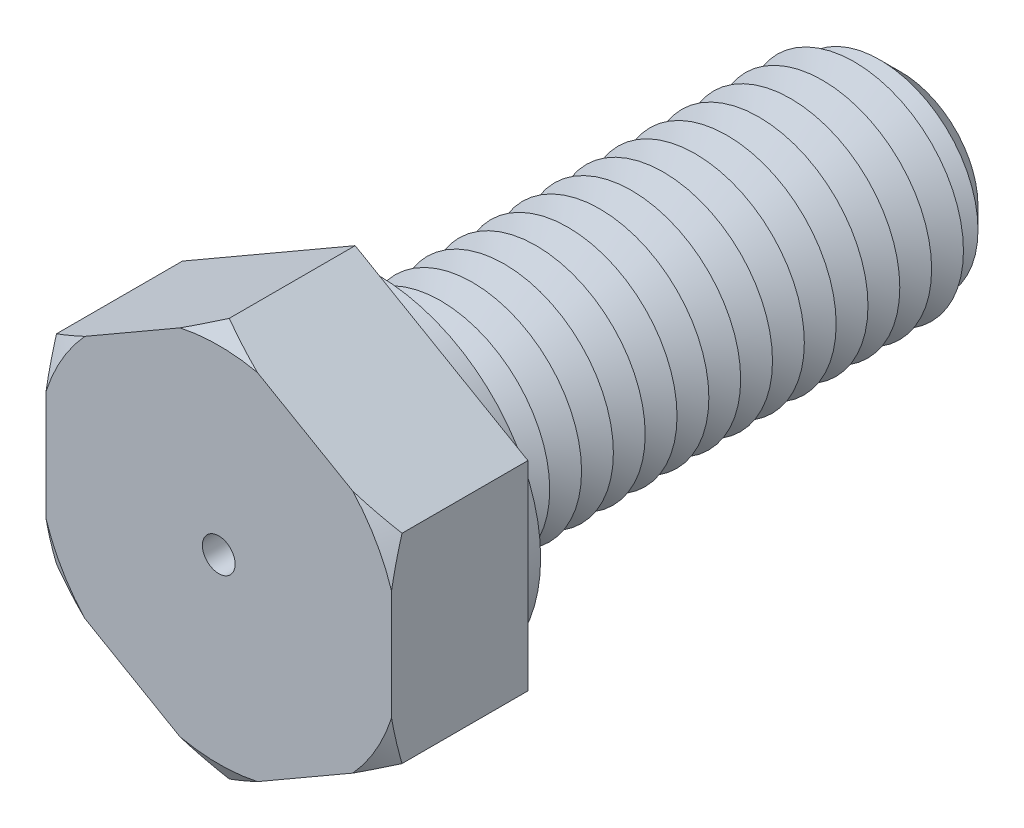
from build123d import *

# Parameters (mm, degrees)
BOSS_EXTRUDE1_DEPTH = 7.5
SKETCH3_R           = 6
BOSS_EXTRUDE2_DEPTH = 30
SKETCH4_R           = 9
BOSS_EXTRUDE3_DEPTH = 1.2
CHAMFER1_SIZE       = 1.75
LPATTERN1_COUNT     = 16
LPATTERN1_PITCH     = 1.75
SKETCH8_R           = 0.9
CUT_EXTRUDE1_DEPTH  = 37.5


with BuildPart() as part:
    # Sketch2 → Boss-Extrude1 (new body)
    with BuildSketch(Plane.XY):
        Polygon((0, 10.969655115), (-9.5, 5.484827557), (-9.5, -5.484827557), (0, -10.969655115), (9.5, -5.484827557), (9.5, 5.484827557), align=None)
    extrude(amount=BOSS_EXTRUDE1_DEPTH)

    # Sketch3 → Boss-Extrude2 (add)
    with BuildSketch(Plane(origin=(0, 0, 0), x_dir=(-1, 0, 0), z_dir=(0, 0, -1))):
        Circle(SKETCH3_R)
    extrude(amount=BOSS_EXTRUDE2_DEPTH)

    # Sketch4 → Boss-Extrude3 (add)
    with BuildSketch(Plane(origin=(0, 0, 0), x_dir=(-1, 0, 0), z_dir=(0, 0, -1))):
        with Locations(Location((0, 0, 0), (0, 0, 180))):
            Circle(SKETCH4_R)
    extrude(amount=BOSS_EXTRUDE3_DEPTH)

    # Chamfer1
    chamfer1_edges = [part.edges().sort_by_distance(p)[0] for p in [
        (6, 0, -30),
    ]]
    chamfer(chamfer1_edges, length=CHAMFER1_SIZE)

    # Sketch6 → Cut-Revolve1 (revolve, cut)
    with BuildSketch(Plane(origin=(0, 0, 0), x_dir=(0, 0, -1), z_dir=(1, 0, 0)), mode=Mode.PRIVATE) as cut_revolve1_sk:
        Polygon((1.2, 6), (2.075, 4.484455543), (2.95, 6), align=None)
    cut_revolve1 = revolve(cut_revolve1_sk.sketch.rotate(Axis((0, 0, 3.211670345), (0, 0, -1)), 90), axis=Axis((0, 0, 3.211670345), (0, 0, -1)), mode=Mode.SUBTRACT)

    # LPattern1: Cut-Revolve1 ×16
    with Locations(*[(0, 0, -i * LPATTERN1_PITCH) for i in range(1, LPATTERN1_COUNT)]):
        add(cut_revolve1, mode=Mode.SUBTRACT)

    # Sketch7 → Cut-Revolve2 (revolve, cut)
    with BuildSketch(Plane(origin=(0, 0, 0), x_dir=(0, 0, -1), z_dir=(1, 0, 0)), mode=Mode.PRIVATE) as cut_revolve2_sk:
        Polygon((-7.5, 10.969655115), (-7.5, 9.969655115), (-6.922649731, 10.969655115), align=None)
    revolve(cut_revolve2_sk.sketch.rotate(Axis((0, 0, 3.211670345), (0, 0, -1)), 90), axis=Axis((0, 0, 3.211670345), (0, 0, -1)), mode=Mode.SUBTRACT)

    # Sketch8 → Cut-Extrude1 (cut)
    with BuildSketch(Plane.XY.offset(7.5)):
        Circle(SKETCH8_R)
    extrude(amount=-CUT_EXTRUDE1_DEPTH, mode=Mode.SUBTRACT)


solid = part.part
